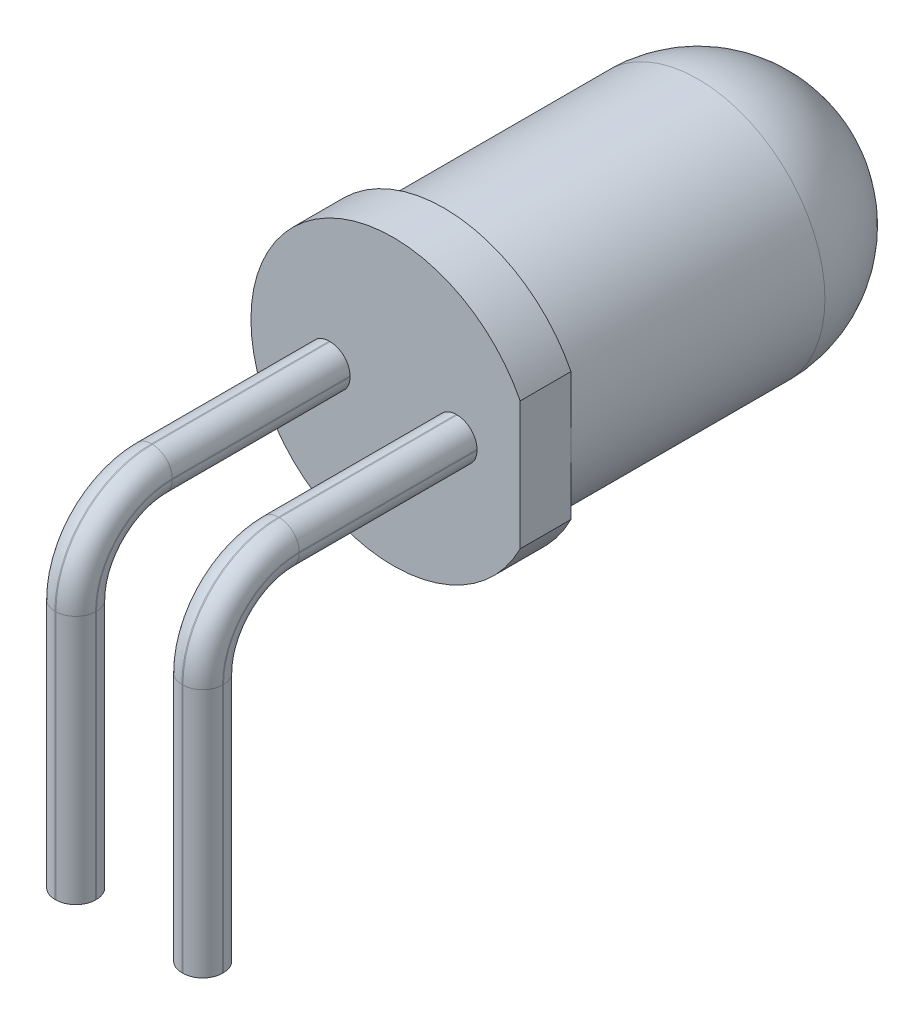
ISO-10303-21;
HEADER;
FILE_DESCRIPTION(('STEP AP214'),'2;1');
FILE_NAME('part.step','',(''),(''),'','','');
FILE_SCHEMA(('AUTOMOTIVE_DESIGN { 1 0 10303 214 1 1 1 1 }'));
ENDSEC;
DATA;
#1=APPLICATION_CONTEXT('core data for automotive mechanical design processes');
#2=APPLICATION_PROTOCOL_DEFINITION('international standard','automotive_design',2000,#1);
#3=PRODUCT_CONTEXT('',#1,'mechanical');
#4=PRODUCT('Part','Part','',(#3));
#5=PRODUCT_RELATED_PRODUCT_CATEGORY('part','',(#4));
#6=PRODUCT_DEFINITION_FORMATION('','',#4);
#7=PRODUCT_DEFINITION_CONTEXT('part definition',#1,'design');
#8=PRODUCT_DEFINITION('design','',#6,#7);
#9=PRODUCT_DEFINITION_SHAPE('','',#8);
#10=(LENGTH_UNIT() NAMED_UNIT(*) SI_UNIT(.MILLI.,.METRE.));
#11=(NAMED_UNIT(*) PLANE_ANGLE_UNIT() SI_UNIT($,.RADIAN.));
#12=(NAMED_UNIT(*) SI_UNIT($,.STERADIAN.) SOLID_ANGLE_UNIT());
#13=UNCERTAINTY_MEASURE_WITH_UNIT(LENGTH_MEASURE(1.E-05),#10,'distance_accuracy_value','');
#14=(GEOMETRIC_REPRESENTATION_CONTEXT(3) GLOBAL_UNCERTAINTY_ASSIGNED_CONTEXT((#13)) GLOBAL_UNIT_ASSIGNED_CONTEXT((#10,
#11,#12)) REPRESENTATION_CONTEXT('',''));
#15=CARTESIAN_POINT('',(0.,0.,0.));
#16=DIRECTION('',(0.,0.,1.));
#17=DIRECTION('',(1.,0.,0.));
#18=AXIS2_PLACEMENT_3D('',#15,#16,#17);
#19=CARTESIAN_POINT('',(1.65,-1.50000032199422,11.9999992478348));
#20=DIRECTION('',(-1.,0.,0.));
#21=DIRECTION('',(0.,0.,1.));
#22=AXIS2_PLACEMENT_3D('',#19,#20,#21);
#23=CYLINDRICAL_SURFACE('',#22,1.10000032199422);
#24=DIRECTION('',(-1.,0.,0.));
#25=VECTOR('',#24,1.);
#26=CARTESIAN_POINT('',(1.65,-0.399999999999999,11.9999993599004));
#27=LINE('',#26,#25);
#28=CARTESIAN_POINT('',(-1.24,-0.399999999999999,11.9999993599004));
#29=VERTEX_POINT('',#28);
#30=CARTESIAN_POINT('',(-1.26,-0.399999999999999,11.9999993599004));
#31=VERTEX_POINT('',#30);
#32=EDGE_CURVE('E490',#29,#31,#27,.T.);
#33=ORIENTED_EDGE('',*,*,#32,.F.);
#34=CARTESIAN_POINT('',(-1.24,-1.50000032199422,11.9999992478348));
#35=DIRECTION('',(1.,0.,0.));
#36=DIRECTION('',(0.,0.,-1.));
#37=AXIS2_PLACEMENT_3D('',#34,#35,#36);
#38=CIRCLE('',#37,1.10000032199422);
#39=CARTESIAN_POINT('',(-1.24,-1.50434905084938,13.0999909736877));
#40=VERTEX_POINT('',#39);
#41=EDGE_CURVE('E377',#29,#40,#38,.T.);
#42=ORIENTED_EDGE('',*,*,#41,.T.);
#43=DIRECTION('',(-1.,0.,0.));
#44=VECTOR('',#43,1.);
#45=CARTESIAN_POINT('',(1.65,-1.50434905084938,13.0999909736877));
#46=LINE('',#45,#44);
#47=CARTESIAN_POINT('',(-1.26,-1.50434905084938,13.0999909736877));
#48=VERTEX_POINT('',#47);
#49=EDGE_CURVE('E465',#40,#48,#46,.T.);
#50=ORIENTED_EDGE('',*,*,#49,.T.);
#51=CARTESIAN_POINT('',(-1.26,-1.50000032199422,11.9999992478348));
#52=DIRECTION('',(1.,0.,0.));
#53=DIRECTION('',(0.,0.,-1.));
#54=AXIS2_PLACEMENT_3D('',#51,#52,#53);
#55=CIRCLE('',#54,1.10000032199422);
#56=EDGE_CURVE('E375',#48,#31,#55,.F.);
#57=ORIENTED_EDGE('',*,*,#56,.T.);
#58=EDGE_LOOP('',(#33,#42,#50,#57));
#59=FACE_BOUND('',#58,.T.);
#60=ADVANCED_FACE('F27',(#59),#23,.F.);
#61=CARTESIAN_POINT('',(1.26,-1.50434905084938,13.0999909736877));
#62=VERTEX_POINT('',#61);
#63=CARTESIAN_POINT('',(1.24,-1.50434905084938,13.0999909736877));
#64=VERTEX_POINT('',#63);
#65=EDGE_CURVE('E469',#62,#64,#46,.T.);
#66=ORIENTED_EDGE('',*,*,#65,.T.);
#67=CARTESIAN_POINT('',(1.24,-1.50000032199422,11.9999992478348));
#68=DIRECTION('',(-1.,0.,0.));
#69=DIRECTION('',(0.,0.,1.));
#70=AXIS2_PLACEMENT_3D('',#67,#68,#69);
#71=CIRCLE('',#70,1.10000032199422);
#72=CARTESIAN_POINT('',(1.24,-0.399999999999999,11.9999993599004));
#73=VERTEX_POINT('',#72);
#74=EDGE_CURVE('E381',#64,#73,#71,.T.);
#75=ORIENTED_EDGE('',*,*,#74,.T.);
#76=CARTESIAN_POINT('',(1.26,-0.399999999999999,11.9999993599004));
#77=VERTEX_POINT('',#76);
#78=EDGE_CURVE('E259',#77,#73,#27,.T.);
#79=ORIENTED_EDGE('',*,*,#78,.F.);
#80=CARTESIAN_POINT('',(1.26,-1.50000032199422,11.9999992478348));
#81=DIRECTION('',(1.,0.,0.));
#82=DIRECTION('',(0.,0.,-1.));
#83=AXIS2_PLACEMENT_3D('',#80,#81,#82);
#84=CIRCLE('',#83,1.10000032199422);
#85=EDGE_CURVE('E379',#77,#62,#84,.T.);
#86=ORIENTED_EDGE('',*,*,#85,.T.);
#87=EDGE_LOOP('',(#66,#75,#79,#86));
#88=FACE_BOUND('',#87,.T.);
#89=ADVANCED_FACE('F620',(#88),#23,.F.);
#90=CARTESIAN_POINT('',(1.65,-0.4,8.4544798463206));
#91=DIRECTION('',(0.,1.,0.));
#92=DIRECTION('',(0.,0.,1.));
#93=AXIS2_PLACEMENT_3D('',#90,#91,#92);
#94=PLANE('',#93);
#95=DIRECTION('',(-1.,0.,0.));
#96=VECTOR('',#95,1.);
#97=CARTESIAN_POINT('',(0.,-0.4,8.5));
#98=LINE('',#97,#96);
#99=CARTESIAN_POINT('',(-1.24,-0.4,8.5));
#100=VERTEX_POINT('',#99);
#101=CARTESIAN_POINT('',(-1.26,-0.4,8.5));
#102=VERTEX_POINT('',#101);
#103=EDGE_CURVE('E297',#100,#102,#98,.T.);
#104=ORIENTED_EDGE('',*,*,#103,.F.);
#105=DIRECTION('',(0.,0.,-1.));
#106=VECTOR('',#105,1.);
#107=CARTESIAN_POINT('',(-1.24,-0.399999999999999,11.9999993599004));
#108=LINE('',#107,#106);
#109=EDGE_CURVE('E317',#100,#29,#108,.F.);
#110=ORIENTED_EDGE('',*,*,#109,.T.);
#111=ORIENTED_EDGE('',*,*,#32,.T.);
#112=DIRECTION('',(0.,0.,-1.));
#113=VECTOR('',#112,1.);
#114=CARTESIAN_POINT('',(-1.26,-0.4,8.4544798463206));
#115=LINE('',#114,#113);
#116=EDGE_CURVE('E314',#31,#102,#115,.T.);
#117=ORIENTED_EDGE('',*,*,#116,.T.);
#118=EDGE_LOOP('',(#104,#110,#111,#117));
#119=FACE_BOUND('',#118,.T.);
#120=ADVANCED_FACE('F500',(#119),#94,.F.);
#121=ORIENTED_EDGE('',*,*,#78,.T.);
#122=DIRECTION('',(0.,0.,1.));
#123=VECTOR('',#122,1.);
#124=CARTESIAN_POINT('',(1.24,-0.4,8.5));
#125=LINE('',#124,#123);
#126=CARTESIAN_POINT('',(1.24,-0.4,8.5));
#127=VERTEX_POINT('',#126);
#128=EDGE_CURVE('E347',#73,#127,#125,.F.);
#129=ORIENTED_EDGE('',*,*,#128,.T.);
#130=CARTESIAN_POINT('',(1.26,-0.4,8.5));
#131=VERTEX_POINT('',#130);
#132=EDGE_CURVE('E293',#131,#127,#98,.T.);
#133=ORIENTED_EDGE('',*,*,#132,.F.);
#134=DIRECTION('',(0.,0.,-1.));
#135=VECTOR('',#134,1.);
#136=CARTESIAN_POINT('',(1.26,-0.399999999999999,11.9999993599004));
#137=LINE('',#136,#135);
#138=EDGE_CURVE('E345',#131,#77,#137,.F.);
#139=ORIENTED_EDGE('',*,*,#138,.T.);
#140=EDGE_LOOP('',(#121,#129,#133,#139));
#141=FACE_BOUND('',#140,.T.);
#142=ADVANCED_FACE('F610',(#141),#94,.F.);
#143=CARTESIAN_POINT('',(1.65,0.4,8.4544798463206));
#144=DIRECTION('',(0.,-1.,0.));
#145=DIRECTION('',(0.,0.,-1.));
#146=AXIS2_PLACEMENT_3D('',#143,#144,#145);
#147=PLANE('',#146);
#148=DIRECTION('',(1.,0.,0.));
#149=VECTOR('',#148,1.);
#150=CARTESIAN_POINT('',(0.,0.400000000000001,8.5));
#151=LINE('',#150,#149);
#152=CARTESIAN_POINT('',(-1.26,0.400000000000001,8.5));
#153=VERTEX_POINT('',#152);
#154=CARTESIAN_POINT('',(-1.24,0.400000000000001,8.5));
#155=VERTEX_POINT('',#154);
#156=EDGE_CURVE('E292',#153,#155,#151,.T.);
#157=ORIENTED_EDGE('',*,*,#156,.F.);
#158=DIRECTION('',(0.,0.,1.));
#159=VECTOR('',#158,1.);
#160=CARTESIAN_POINT('',(-1.26,0.4,8.4544798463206));
#161=LINE('',#160,#159);
#162=CARTESIAN_POINT('',(-1.26,0.400000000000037,11.9999993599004));
#163=VERTEX_POINT('',#162);
#164=EDGE_CURVE('E385',#153,#163,#161,.T.);
#165=ORIENTED_EDGE('',*,*,#164,.T.);
#166=DIRECTION('',(-1.,0.,0.));
#167=VECTOR('',#166,1.);
#168=CARTESIAN_POINT('',(1.65,0.400000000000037,11.9999993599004));
#169=LINE('',#168,#167);
#170=CARTESIAN_POINT('',(-1.24,0.400000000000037,11.9999993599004));
#171=VERTEX_POINT('',#170);
#172=EDGE_CURVE('E486',#171,#163,#169,.T.);
#173=ORIENTED_EDGE('',*,*,#172,.F.);
#174=DIRECTION('',(0.,0.,1.));
#175=VECTOR('',#174,1.);
#176=CARTESIAN_POINT('',(-1.24,0.400000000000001,8.5));
#177=LINE('',#176,#175);
#178=EDGE_CURVE('E383',#171,#155,#177,.F.);
#179=ORIENTED_EDGE('',*,*,#178,.T.);
#180=EDGE_LOOP('',(#157,#165,#173,#179));
#181=FACE_BOUND('',#180,.T.);
#182=ADVANCED_FACE('F607',(#181),#147,.F.);
#183=CARTESIAN_POINT('',(1.24,0.400000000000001,8.5));
#184=VERTEX_POINT('',#183);
#185=CARTESIAN_POINT('',(1.26,0.400000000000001,8.5));
#186=VERTEX_POINT('',#185);
#187=EDGE_CURVE('E289',#184,#186,#151,.T.);
#188=ORIENTED_EDGE('',*,*,#187,.F.);
#189=DIRECTION('',(0.,0.,-1.));
#190=VECTOR('',#189,1.);
#191=CARTESIAN_POINT('',(1.24,0.400000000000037,11.9999993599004));
#192=LINE('',#191,#190);
#193=CARTESIAN_POINT('',(1.24,0.400000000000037,11.9999993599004));
#194=VERTEX_POINT('',#193);
#195=EDGE_CURVE('E394',#184,#194,#192,.F.);
#196=ORIENTED_EDGE('',*,*,#195,.T.);
#197=CARTESIAN_POINT('',(1.26,0.400000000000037,11.9999993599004));
#198=VERTEX_POINT('',#197);
#199=EDGE_CURVE('E488',#198,#194,#169,.T.);
#200=ORIENTED_EDGE('',*,*,#199,.F.);
#201=DIRECTION('',(0.,0.,1.));
#202=VECTOR('',#201,1.);
#203=CARTESIAN_POINT('',(1.26,0.400000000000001,8.5));
#204=LINE('',#203,#202);
#205=EDGE_CURVE('E392',#198,#186,#204,.F.);
#206=ORIENTED_EDGE('',*,*,#205,.T.);
#207=EDGE_LOOP('',(#188,#196,#200,#206));
#208=FACE_BOUND('',#207,.T.);
#209=ADVANCED_FACE('F609',(#208),#147,.F.);
#210=CARTESIAN_POINT('',(1.65,-1.50000032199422,11.9999992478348));
#211=DIRECTION('',(-1.,0.,0.));
#212=DIRECTION('',(0.,0.,1.));
#213=AXIS2_PLACEMENT_3D('',#210,#211,#212);
#214=CYLINDRICAL_SURFACE('',#213,1.90000032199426);
#215=ORIENTED_EDGE('',*,*,#172,.T.);
#216=CARTESIAN_POINT('',(-1.26,-1.50000032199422,11.9999992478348));
#217=DIRECTION('',(1.,0.,0.));
#218=DIRECTION('',(0.,0.,-1.));
#219=AXIS2_PLACEMENT_3D('',#216,#217,#218);
#220=CIRCLE('',#219,1.90000032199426);
#221=CARTESIAN_POINT('',(-1.26,-1.50289165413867,13.8999973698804));
#222=VERTEX_POINT('',#221);
#223=EDGE_CURVE('E390',#163,#222,#220,.T.);
#224=ORIENTED_EDGE('',*,*,#223,.T.);
#225=DIRECTION('',(-1.,0.,0.));
#226=VECTOR('',#225,1.);
#227=CARTESIAN_POINT('',(1.65,-1.50289165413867,13.8999973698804));
#228=LINE('',#227,#226);
#229=CARTESIAN_POINT('',(-1.24,-1.50289165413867,13.8999973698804));
#230=VERTEX_POINT('',#229);
#231=EDGE_CURVE('E487',#230,#222,#228,.T.);
#232=ORIENTED_EDGE('',*,*,#231,.F.);
#233=CARTESIAN_POINT('',(-1.24,-1.50000032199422,11.9999992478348));
#234=DIRECTION('',(1.,0.,0.));
#235=DIRECTION('',(0.,0.,-1.));
#236=AXIS2_PLACEMENT_3D('',#233,#234,#235);
#237=CIRCLE('',#236,1.90000032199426);
#238=EDGE_CURVE('E388',#230,#171,#237,.F.);
#239=ORIENTED_EDGE('',*,*,#238,.T.);
#240=EDGE_LOOP('',(#215,#224,#232,#239));
#241=FACE_BOUND('',#240,.T.);
#242=ADVANCED_FACE('F605',(#241),#214,.T.);
#243=ORIENTED_EDGE('',*,*,#199,.T.);
#244=CARTESIAN_POINT('',(1.24,-1.50000032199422,11.9999992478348));
#245=DIRECTION('',(-1.,0.,0.));
#246=DIRECTION('',(0.,0.,1.));
#247=AXIS2_PLACEMENT_3D('',#244,#245,#246);
#248=CIRCLE('',#247,1.90000032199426);
#249=CARTESIAN_POINT('',(1.24,-1.50289165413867,13.8999973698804));
#250=VERTEX_POINT('',#249);
#251=EDGE_CURVE('E398',#194,#250,#248,.F.);
#252=ORIENTED_EDGE('',*,*,#251,.T.);
#253=CARTESIAN_POINT('',(1.26,-1.50289165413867,13.8999973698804));
#254=VERTEX_POINT('',#253);
#255=EDGE_CURVE('E483',#254,#250,#228,.T.);
#256=ORIENTED_EDGE('',*,*,#255,.F.);
#257=CARTESIAN_POINT('',(1.26,-1.50000032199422,11.9999992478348));
#258=DIRECTION('',(1.,0.,0.));
#259=DIRECTION('',(0.,0.,-1.));
#260=AXIS2_PLACEMENT_3D('',#257,#258,#259);
#261=CIRCLE('',#260,1.90000032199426);
#262=EDGE_CURVE('E396',#254,#198,#261,.F.);
#263=ORIENTED_EDGE('',*,*,#262,.T.);
#264=EDGE_LOOP('',(#243,#252,#256,#263));
#265=FACE_BOUND('',#264,.T.);
#266=ADVANCED_FACE('F854',(#265),#214,.T.);
#267=CARTESIAN_POINT('',(1.65,-6.41788355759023,13.8999973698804));
#268=DIRECTION('',(0.,0.,-1.));
#269=DIRECTION('',(-1.,0.,0.));
#270=AXIS2_PLACEMENT_3D('',#267,#268,#269);
#271=PLANE('',#270);
#272=ORIENTED_EDGE('',*,*,#231,.T.);
#273=DIRECTION('',(0.,-1.,0.));
#274=VECTOR('',#273,1.);
#275=CARTESIAN_POINT('',(-1.26,-6.41788355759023,13.8999973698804));
#276=LINE('',#275,#274);
#277=CARTESIAN_POINT('',(-1.26,-6.41788355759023,13.8999973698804));
#278=VERTEX_POINT('',#277);
#279=EDGE_CURVE('E42',#222,#278,#276,.T.);
#280=ORIENTED_EDGE('',*,*,#279,.T.);
#281=DIRECTION('',(-1.,0.,0.));
#282=VECTOR('',#281,1.);
#283=CARTESIAN_POINT('',(1.65,-6.41788355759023,13.8999973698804));
#284=LINE('',#283,#282);
#285=CARTESIAN_POINT('',(-1.24,-6.41788355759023,13.8999973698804));
#286=VERTEX_POINT('',#285);
#287=EDGE_CURVE('E480',#286,#278,#284,.T.);
#288=ORIENTED_EDGE('',*,*,#287,.F.);
#289=DIRECTION('',(0.,-1.,0.));
#290=VECTOR('',#289,1.);
#291=CARTESIAN_POINT('',(-1.24,-1.50289165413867,13.8999973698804));
#292=LINE('',#291,#290);
#293=EDGE_CURVE('E415',#286,#230,#292,.F.);
#294=ORIENTED_EDGE('',*,*,#293,.T.);
#295=EDGE_LOOP('',(#272,#280,#288,#294));
#296=FACE_BOUND('',#295,.T.);
#297=ADVANCED_FACE('F852',(#296),#271,.F.);
#298=CARTESIAN_POINT('',(1.26,-6.41788355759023,13.8999973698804));
#299=VERTEX_POINT('',#298);
#300=CARTESIAN_POINT('',(1.24,-6.41788355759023,13.8999973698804));
#301=VERTEX_POINT('',#300);
#302=EDGE_CURVE('E482',#299,#301,#284,.T.);
#303=ORIENTED_EDGE('',*,*,#302,.F.);
#304=DIRECTION('',(0.,-1.,0.));
#305=VECTOR('',#304,1.);
#306=CARTESIAN_POINT('',(1.26,-1.50289165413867,13.8999973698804));
#307=LINE('',#306,#305);
#308=EDGE_CURVE('E402',#299,#254,#307,.F.);
#309=ORIENTED_EDGE('',*,*,#308,.T.);
#310=ORIENTED_EDGE('',*,*,#255,.T.);
#311=DIRECTION('',(0.,1.,0.));
#312=VECTOR('',#311,1.);
#313=CARTESIAN_POINT('',(1.24,-6.41788355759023,13.8999973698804));
#314=LINE('',#313,#312);
#315=EDGE_CURVE('E400',#250,#301,#314,.F.);
#316=ORIENTED_EDGE('',*,*,#315,.T.);
#317=EDGE_LOOP('',(#303,#309,#310,#316));
#318=FACE_BOUND('',#317,.T.);
#319=ADVANCED_FACE('F851',(#318),#271,.F.);
#320=CARTESIAN_POINT('',(1.65,-6.41788355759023,13.0999909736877));
#321=DIRECTION('',(0.,1.,0.));
#322=DIRECTION('',(0.,0.,1.));
#323=AXIS2_PLACEMENT_3D('',#320,#321,#322);
#324=PLANE('',#323);
#325=DIRECTION('',(-1.,0.,0.));
#326=VECTOR('',#325,1.);
#327=CARTESIAN_POINT('',(1.65,-6.41788355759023,13.0999909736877));
#328=LINE('',#327,#326);
#329=CARTESIAN_POINT('',(-1.24,-6.41788355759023,13.0999909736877));
#330=VERTEX_POINT('',#329);
#331=CARTESIAN_POINT('',(-1.26,-6.41788355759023,13.0999909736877));
#332=VERTEX_POINT('',#331);
#333=EDGE_CURVE('E476',#330,#332,#328,.T.);
#334=ORIENTED_EDGE('',*,*,#333,.F.);
#335=CARTESIAN_POINT('',(-1.24,-6.41788355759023,13.4899909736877));
#336=DIRECTION('',(0.,1.,0.));
#337=DIRECTION('',(0.,0.,1.));
#338=AXIS2_PLACEMENT_3D('',#335,#336,#337);
#339=CIRCLE('',#338,0.39);
#340=CARTESIAN_POINT('',(-0.85,-6.41788355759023,13.4899909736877));
#341=VERTEX_POINT('',#340);
#342=EDGE_CURVE('E413',#330,#341,#339,.F.);
#343=ORIENTED_EDGE('',*,*,#342,.T.);
#344=DIRECTION('',(0.,0.,-1.));
#345=VECTOR('',#344,1.);
#346=CARTESIAN_POINT('',(-0.85,-6.41788355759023,13.0999909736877));
#347=LINE('',#346,#345);
#348=CARTESIAN_POINT('',(-0.85,-6.41788355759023,13.5099973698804));
#349=VERTEX_POINT('',#348);
#350=EDGE_CURVE('E472',#349,#341,#347,.T.);
#351=ORIENTED_EDGE('',*,*,#350,.F.);
#352=CARTESIAN_POINT('',(-1.24,-6.41788355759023,13.5099973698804));
#353=DIRECTION('',(0.,1.,0.));
#354=DIRECTION('',(0.,0.,1.));
#355=AXIS2_PLACEMENT_3D('',#352,#353,#354);
#356=CIRCLE('',#355,0.39);
#357=EDGE_CURVE('E49',#349,#286,#356,.F.);
#358=ORIENTED_EDGE('',*,*,#357,.T.);
#359=ORIENTED_EDGE('',*,*,#287,.T.);
#360=CARTESIAN_POINT('',(-1.26,-6.41788355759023,13.5099973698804));
#361=DIRECTION('',(0.,1.,0.));
#362=DIRECTION('',(0.,0.,1.));
#363=AXIS2_PLACEMENT_3D('',#360,#361,#362);
#364=CIRCLE('',#363,0.39);
#365=CARTESIAN_POINT('',(-1.65,-6.41788355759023,13.5099973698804));
#366=VERTEX_POINT('',#365);
#367=EDGE_CURVE('E409',#278,#366,#364,.F.);
#368=ORIENTED_EDGE('',*,*,#367,.T.);
#369=DIRECTION('',(0.,0.,-1.));
#370=VECTOR('',#369,1.);
#371=CARTESIAN_POINT('',(-1.65,-6.41788355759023,13.0999909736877));
#372=LINE('',#371,#370);
#373=CARTESIAN_POINT('',(-1.65,-6.41788355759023,13.4899909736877));
#374=VERTEX_POINT('',#373);
#375=EDGE_CURVE('E466',#366,#374,#372,.T.);
#376=ORIENTED_EDGE('',*,*,#375,.T.);
#377=CARTESIAN_POINT('',(-1.26,-6.41788355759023,13.4899909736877));
#378=DIRECTION('',(0.,1.,0.));
#379=DIRECTION('',(0.,0.,1.));
#380=AXIS2_PLACEMENT_3D('',#377,#378,#379);
#381=CIRCLE('',#380,0.39);
#382=EDGE_CURVE('E411',#374,#332,#381,.F.);
#383=ORIENTED_EDGE('',*,*,#382,.T.);
#384=EDGE_LOOP('',(#334,#343,#351,#358,#359,#368,#376,#383));
#385=FACE_BOUND('',#384,.T.);
#386=ADVANCED_FACE('F848',(#385),#324,.F.);
#387=CARTESIAN_POINT('',(1.26,-6.41788355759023,13.0999909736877));
#388=VERTEX_POINT('',#387);
#389=CARTESIAN_POINT('',(1.24,-6.41788355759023,13.0999909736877));
#390=VERTEX_POINT('',#389);
#391=EDGE_CURVE('E479',#388,#390,#328,.T.);
#392=ORIENTED_EDGE('',*,*,#391,.F.);
#393=CARTESIAN_POINT('',(1.26,-6.41788355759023,13.4899909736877));
#394=DIRECTION('',(0.,1.,0.));
#395=DIRECTION('',(0.,0.,1.));
#396=AXIS2_PLACEMENT_3D('',#393,#394,#395);
#397=CIRCLE('',#396,0.39);
#398=CARTESIAN_POINT('',(1.65,-6.41788355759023,13.4899909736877));
#399=VERTEX_POINT('',#398);
#400=EDGE_CURVE('E373',#388,#399,#397,.F.);
#401=ORIENTED_EDGE('',*,*,#400,.T.);
#402=DIRECTION('',(0.,0.,-1.));
#403=VECTOR('',#402,1.);
#404=CARTESIAN_POINT('',(1.65,-6.41788355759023,13.0999909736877));
#405=LINE('',#404,#403);
#406=CARTESIAN_POINT('',(1.65,-6.41788355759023,13.5099973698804));
#407=VERTEX_POINT('',#406);
#408=EDGE_CURVE('E456',#407,#399,#405,.T.);
#409=ORIENTED_EDGE('',*,*,#408,.F.);
#410=CARTESIAN_POINT('',(1.26,-6.41788355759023,13.5099973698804));
#411=DIRECTION('',(0.,1.,0.));
#412=DIRECTION('',(0.,0.,1.));
#413=AXIS2_PLACEMENT_3D('',#410,#411,#412);
#414=CIRCLE('',#413,0.39);
#415=EDGE_CURVE('E371',#407,#299,#414,.F.);
#416=ORIENTED_EDGE('',*,*,#415,.T.);
#417=ORIENTED_EDGE('',*,*,#302,.T.);
#418=CARTESIAN_POINT('',(1.24,-6.41788355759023,13.5099973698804));
#419=DIRECTION('',(0.,1.,0.));
#420=DIRECTION('',(0.,0.,1.));
#421=AXIS2_PLACEMENT_3D('',#418,#419,#420);
#422=CIRCLE('',#421,0.39);
#423=CARTESIAN_POINT('',(0.85,-6.41788355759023,13.5099973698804));
#424=VERTEX_POINT('',#423);
#425=EDGE_CURVE('E367',#301,#424,#422,.F.);
#426=ORIENTED_EDGE('',*,*,#425,.T.);
#427=DIRECTION('',(0.,0.,1.));
#428=VECTOR('',#427,1.);
#429=CARTESIAN_POINT('',(0.85,-6.41788355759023,13.0999909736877));
#430=LINE('',#429,#428);
#431=CARTESIAN_POINT('',(0.85,-6.41788355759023,13.4899909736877));
#432=VERTEX_POINT('',#431);
#433=EDGE_CURVE('E567',#432,#424,#430,.T.);
#434=ORIENTED_EDGE('',*,*,#433,.F.);
#435=CARTESIAN_POINT('',(1.24,-6.41788355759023,13.4899909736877));
#436=DIRECTION('',(0.,1.,0.));
#437=DIRECTION('',(0.,0.,1.));
#438=AXIS2_PLACEMENT_3D('',#435,#436,#437);
#439=CIRCLE('',#438,0.39);
#440=EDGE_CURVE('E369',#432,#390,#439,.F.);
#441=ORIENTED_EDGE('',*,*,#440,.T.);
#442=EDGE_LOOP('',(#392,#401,#409,#416,#417,#426,#434,#441));
#443=FACE_BOUND('',#442,.T.);
#444=ADVANCED_FACE('F461',(#443),#324,.F.);
#445=CARTESIAN_POINT('',(1.65,-1.50434905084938,13.0999909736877));
#446=DIRECTION('',(0.,0.,1.));
#447=DIRECTION('',(1.,0.,0.));
#448=AXIS2_PLACEMENT_3D('',#445,#446,#447);
#449=PLANE('',#448);
#450=ORIENTED_EDGE('',*,*,#49,.F.);
#451=DIRECTION('',(0.,1.,0.));
#452=VECTOR('',#451,1.);
#453=CARTESIAN_POINT('',(-1.24,-6.41788355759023,13.0999909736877));
#454=LINE('',#453,#452);
#455=EDGE_CURVE('E406',#40,#330,#454,.F.);
#456=ORIENTED_EDGE('',*,*,#455,.T.);
#457=ORIENTED_EDGE('',*,*,#333,.T.);
#458=DIRECTION('',(0.,1.,0.));
#459=VECTOR('',#458,1.);
#460=CARTESIAN_POINT('',(-1.26,-1.50434905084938,13.0999909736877));
#461=LINE('',#460,#459);
#462=EDGE_CURVE('E404',#332,#48,#461,.T.);
#463=ORIENTED_EDGE('',*,*,#462,.T.);
#464=EDGE_LOOP('',(#450,#456,#457,#463));
#465=FACE_BOUND('',#464,.T.);
#466=ADVANCED_FACE('F845',(#465),#449,.F.);
#467=ORIENTED_EDGE('',*,*,#65,.F.);
#468=DIRECTION('',(0.,1.,0.));
#469=VECTOR('',#468,1.);
#470=CARTESIAN_POINT('',(1.26,-6.41788355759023,13.0999909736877));
#471=LINE('',#470,#469);
#472=EDGE_CURVE('E365',#62,#388,#471,.F.);
#473=ORIENTED_EDGE('',*,*,#472,.T.);
#474=ORIENTED_EDGE('',*,*,#391,.T.);
#475=DIRECTION('',(0.,-1.,0.));
#476=VECTOR('',#475,1.);
#477=CARTESIAN_POINT('',(1.24,-1.50434905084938,13.0999909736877));
#478=LINE('',#477,#476);
#479=EDGE_CURVE('E363',#390,#64,#478,.F.);
#480=ORIENTED_EDGE('',*,*,#479,.T.);
#481=EDGE_LOOP('',(#467,#473,#474,#480));
#482=FACE_BOUND('',#481,.T.);
#483=ADVANCED_FACE('F647',(#482),#449,.F.);
#484=CARTESIAN_POINT('',(0.,0.,8.5));
#485=DIRECTION('',(0.,0.,-1.));
#486=DIRECTION('',(-1.,0.,0.));
#487=AXIS2_PLACEMENT_3D('',#484,#485,#486);
#488=CYLINDRICAL_SURFACE('',#487,2.5);
#489=CARTESIAN_POINT('',(0.,0.,2.5));
#490=DIRECTION('',(0.,0.,-1.));
#491=DIRECTION('',(-1.,0.,0.));
#492=AXIS2_PLACEMENT_3D('',#489,#490,#491);
#493=CIRCLE('',#492,2.5);
#494=CARTESIAN_POINT('',(-2.5,0.,2.5));
#495=VERTEX_POINT('',#494);
#496=EDGE_CURVE('E283',#495,#495,#493,.F.);
#497=ORIENTED_EDGE('',*,*,#496,.T.);
#498=EDGE_LOOP('',(#497));
#499=FACE_BOUND('',#498,.T.);
#500=CARTESIAN_POINT('',(0.,0.,7.5));
#501=DIRECTION('',(0.,0.,1.));
#502=DIRECTION('',(1.,0.,0.));
#503=AXIS2_PLACEMENT_3D('',#500,#501,#502);
#504=CIRCLE('',#503,2.5);
#505=CARTESIAN_POINT('',(2.5,0.,7.5));
#506=VERTEX_POINT('',#505);
#507=EDGE_CURVE('E279',#506,#506,#504,.T.);
#508=ORIENTED_EDGE('',*,*,#507,.F.);
#509=EDGE_LOOP('',(#508));
#510=FACE_BOUND('',#509,.T.);
#511=ADVANCED_FACE('F29',(#499,#510),#488,.T.);
#512=CARTESIAN_POINT('',(0.,0.,7.5));
#513=DIRECTION('',(0.,0.,1.));
#514=DIRECTION('',(1.,0.,0.));
#515=AXIS2_PLACEMENT_3D('',#512,#513,#514);
#516=PLANE('',#515);
#517=DIRECTION('',(0.,1.,0.));
#518=VECTOR('',#517,1.);
#519=CARTESIAN_POINT('',(2.5,1.26095202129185,7.5));
#520=LINE('',#519,#518);
#521=CARTESIAN_POINT('',(2.5,1.26095202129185,7.5));
#522=VERTEX_POINT('',#521);
#523=EDGE_CURVE('E274',#506,#522,#520,.T.);
#524=ORIENTED_EDGE('',*,*,#523,.F.);
#525=ORIENTED_EDGE('',*,*,#507,.T.);
#526=CARTESIAN_POINT('',(2.5,-1.26095202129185,7.5));
#527=VERTEX_POINT('',#526);
#528=EDGE_CURVE('E270',#527,#506,#520,.T.);
#529=ORIENTED_EDGE('',*,*,#528,.F.);
#530=CARTESIAN_POINT('',(0.,0.,7.5));
#531=DIRECTION('',(0.,0.,1.));
#532=DIRECTION('',(1.,0.,0.));
#533=AXIS2_PLACEMENT_3D('',#530,#531,#532);
#534=CIRCLE('',#533,2.8);
#535=EDGE_CURVE('E265',#522,#527,#534,.T.);
#536=ORIENTED_EDGE('',*,*,#535,.F.);
#537=EDGE_LOOP('',(#524,#525,#529,#536));
#538=FACE_BOUND('',#537,.T.);
#539=ADVANCED_FACE('F632',(#538),#516,.F.);
#540=CARTESIAN_POINT('',(2.5,1.26095202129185,7.5));
#541=DIRECTION('',(1.,0.,0.));
#542=DIRECTION('',(0.,0.,-1.));
#543=AXIS2_PLACEMENT_3D('',#540,#541,#542);
#544=PLANE('',#543);
#545=ORIENTED_EDGE('',*,*,#528,.T.);
#546=ORIENTED_EDGE('',*,*,#523,.T.);
#547=DIRECTION('',(0.,0.,1.));
#548=VECTOR('',#547,1.);
#549=CARTESIAN_POINT('',(2.5,1.26095202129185,7.5));
#550=LINE('',#549,#548);
#551=CARTESIAN_POINT('',(2.5,1.26095202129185,8.5));
#552=VERTEX_POINT('',#551);
#553=EDGE_CURVE('E269',#522,#552,#550,.T.);
#554=ORIENTED_EDGE('',*,*,#553,.T.);
#555=DIRECTION('',(0.,1.,0.));
#556=VECTOR('',#555,1.);
#557=CARTESIAN_POINT('',(2.5,1.26095202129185,8.5));
#558=LINE('',#557,#556);
#559=CARTESIAN_POINT('',(2.5,-1.26095202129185,8.5));
#560=VERTEX_POINT('',#559);
#561=EDGE_CURVE('E255',#560,#552,#558,.T.);
#562=ORIENTED_EDGE('',*,*,#561,.F.);
#563=DIRECTION('',(0.,0.,1.));
#564=VECTOR('',#563,1.);
#565=CARTESIAN_POINT('',(2.5,-1.26095202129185,7.5));
#566=LINE('',#565,#564);
#567=EDGE_CURVE('E262',#527,#560,#566,.T.);
#568=ORIENTED_EDGE('',*,*,#567,.F.);
#569=EDGE_LOOP('',(#545,#546,#554,#562,#568));
#570=FACE_BOUND('',#569,.T.);
#571=ADVANCED_FACE('F272',(#570),#544,.T.);
#572=CARTESIAN_POINT('',(0.,0.,7.5));
#573=DIRECTION('',(0.,0.,1.));
#574=DIRECTION('',(1.,0.,0.));
#575=AXIS2_PLACEMENT_3D('',#572,#573,#574);
#576=CYLINDRICAL_SURFACE('',#575,2.8);
#577=CARTESIAN_POINT('',(0.,0.,8.5));
#578=DIRECTION('',(0.,0.,1.));
#579=DIRECTION('',(1.,0.,0.));
#580=AXIS2_PLACEMENT_3D('',#577,#578,#579);
#581=CIRCLE('',#580,2.8);
#582=EDGE_CURVE('E251',#552,#560,#581,.T.);
#583=ORIENTED_EDGE('',*,*,#582,.F.);
#584=ORIENTED_EDGE('',*,*,#553,.F.);
#585=ORIENTED_EDGE('',*,*,#535,.T.);
#586=ORIENTED_EDGE('',*,*,#567,.T.);
#587=EDGE_LOOP('',(#583,#584,#585,#586));
#588=FACE_BOUND('',#587,.T.);
#589=ADVANCED_FACE('F263',(#588),#576,.T.);
#590=CARTESIAN_POINT('',(0.,0.,8.5));
#591=DIRECTION('',(0.,0.,1.));
#592=DIRECTION('',(1.,0.,0.));
#593=AXIS2_PLACEMENT_3D('',#590,#591,#592);
#594=PLANE('',#593);
#595=ORIENTED_EDGE('',*,*,#156,.T.);
#596=CARTESIAN_POINT('',(-1.24,0.0100000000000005,8.5));
#597=DIRECTION('',(0.,0.,1.));
#598=DIRECTION('',(1.,0.,0.));
#599=AXIS2_PLACEMENT_3D('',#596,#597,#598);
#600=CIRCLE('',#599,0.39);
#601=CARTESIAN_POINT('',(-0.85,0.0100000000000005,8.5));
#602=VERTEX_POINT('',#601);
#603=EDGE_CURVE('E426',#155,#602,#600,.F.);
#604=ORIENTED_EDGE('',*,*,#603,.T.);
#605=DIRECTION('',(0.,-1.,0.));
#606=VECTOR('',#605,1.);
#607=CARTESIAN_POINT('',(-0.85,0.623900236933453,8.5));
#608=LINE('',#607,#606);
#609=CARTESIAN_POINT('',(-0.85,-0.01,8.5));
#610=VERTEX_POINT('',#609);
#611=EDGE_CURVE('E561',#602,#610,#608,.T.);
#612=ORIENTED_EDGE('',*,*,#611,.T.);
#613=CARTESIAN_POINT('',(-1.24,-0.0100000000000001,8.5));
#614=DIRECTION('',(0.,0.,1.));
#615=DIRECTION('',(1.,0.,0.));
#616=AXIS2_PLACEMENT_3D('',#613,#614,#615);
#617=CIRCLE('',#616,0.39);
#618=EDGE_CURVE('E418',#610,#100,#617,.F.);
#619=ORIENTED_EDGE('',*,*,#618,.T.);
#620=ORIENTED_EDGE('',*,*,#103,.T.);
#621=CARTESIAN_POINT('',(-1.26,-0.01,8.5));
#622=DIRECTION('',(0.,0.,1.));
#623=DIRECTION('',(1.,0.,0.));
#624=AXIS2_PLACEMENT_3D('',#621,#622,#623);
#625=CIRCLE('',#624,0.39);
#626=CARTESIAN_POINT('',(-1.65,-0.01,8.5));
#627=VERTEX_POINT('',#626);
#628=EDGE_CURVE('E420',#102,#627,#625,.F.);
#629=ORIENTED_EDGE('',*,*,#628,.T.);
#630=DIRECTION('',(0.,1.,0.));
#631=VECTOR('',#630,1.);
#632=CARTESIAN_POINT('',(-1.65,0.,8.5));
#633=LINE('',#632,#631);
#634=CARTESIAN_POINT('',(-1.65,0.0100000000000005,8.5));
#635=VERTEX_POINT('',#634);
#636=EDGE_CURVE('E286',#627,#635,#633,.T.);
#637=ORIENTED_EDGE('',*,*,#636,.T.);
#638=CARTESIAN_POINT('',(-1.26,0.0100000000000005,8.5));
#639=DIRECTION('',(0.,0.,1.));
#640=DIRECTION('',(1.,0.,0.));
#641=AXIS2_PLACEMENT_3D('',#638,#639,#640);
#642=CIRCLE('',#641,0.39);
#643=EDGE_CURVE('E424',#635,#153,#642,.F.);
#644=ORIENTED_EDGE('',*,*,#643,.T.);
#645=EDGE_LOOP('',(#595,#604,#612,#619,#620,#629,#637,#644));
#646=FACE_BOUND('',#645,.T.);
#647=ORIENTED_EDGE('',*,*,#132,.T.);
#648=CARTESIAN_POINT('',(1.24,-0.0100000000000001,8.5));
#649=DIRECTION('',(0.,0.,1.));
#650=DIRECTION('',(1.,0.,0.));
#651=AXIS2_PLACEMENT_3D('',#648,#649,#650);
#652=CIRCLE('',#651,0.39);
#653=CARTESIAN_POINT('',(0.85,-0.01,8.5));
#654=VERTEX_POINT('',#653);
#655=EDGE_CURVE('E422',#127,#654,#652,.F.);
#656=ORIENTED_EDGE('',*,*,#655,.T.);
#657=DIRECTION('',(0.,1.,0.));
#658=VECTOR('',#657,1.);
#659=CARTESIAN_POINT('',(0.85,0.623900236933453,8.5));
#660=LINE('',#659,#658);
#661=CARTESIAN_POINT('',(0.85,0.0100000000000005,8.5));
#662=VERTEX_POINT('',#661);
#663=EDGE_CURVE('E564',#654,#662,#660,.T.);
#664=ORIENTED_EDGE('',*,*,#663,.T.);
#665=CARTESIAN_POINT('',(1.24,0.0100000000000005,8.5));
#666=DIRECTION('',(0.,0.,1.));
#667=DIRECTION('',(1.,0.,0.));
#668=AXIS2_PLACEMENT_3D('',#665,#666,#667);
#669=CIRCLE('',#668,0.39);
#670=EDGE_CURVE('E428',#662,#184,#669,.F.);
#671=ORIENTED_EDGE('',*,*,#670,.T.);
#672=ORIENTED_EDGE('',*,*,#187,.T.);
#673=CARTESIAN_POINT('',(1.26,0.0100000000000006,8.5));
#674=DIRECTION('',(0.,0.,1.));
#675=DIRECTION('',(1.,0.,0.));
#676=AXIS2_PLACEMENT_3D('',#673,#674,#675);
#677=CIRCLE('',#676,0.39);
#678=CARTESIAN_POINT('',(1.65,0.0100000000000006,8.5));
#679=VERTEX_POINT('',#678);
#680=EDGE_CURVE('E35',#186,#679,#677,.F.);
#681=ORIENTED_EDGE('',*,*,#680,.T.);
#682=DIRECTION('',(0.,1.,0.));
#683=VECTOR('',#682,1.);
#684=CARTESIAN_POINT('',(1.65,0.,8.5));
#685=LINE('',#684,#683);
#686=CARTESIAN_POINT('',(1.65,-0.0100000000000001,8.5));
#687=VERTEX_POINT('',#686);
#688=EDGE_CURVE('E296',#687,#679,#685,.T.);
#689=ORIENTED_EDGE('',*,*,#688,.F.);
#690=CARTESIAN_POINT('',(1.26,-0.0100000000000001,8.5));
#691=DIRECTION('',(0.,0.,1.));
#692=DIRECTION('',(1.,0.,0.));
#693=AXIS2_PLACEMENT_3D('',#690,#691,#692);
#694=CIRCLE('',#693,0.39);
#695=EDGE_CURVE('E11',#687,#131,#694,.F.);
#696=ORIENTED_EDGE('',*,*,#695,.T.);
#697=EDGE_LOOP('',(#647,#656,#664,#671,#672,#681,#689,#696));
#698=FACE_BOUND('',#697,.T.);
#699=ORIENTED_EDGE('',*,*,#582,.T.);
#700=ORIENTED_EDGE('',*,*,#561,.T.);
#701=EDGE_LOOP('',(#699,#700));
#702=FACE_BOUND('',#701,.T.);
#703=ADVANCED_FACE('F253',(#646,#698,#702),#594,.T.);
#704=CARTESIAN_POINT('',(0.,0.,2.5));
#705=DIRECTION('',(0.,0.,1.));
#706=DIRECTION('',(1.,0.,0.));
#707=AXIS2_PLACEMENT_3D('',#704,#705,#706);
#708=SPHERICAL_SURFACE('',#707,2.5);
#709=ORIENTED_EDGE('',*,*,#496,.F.);
#710=EDGE_LOOP('',(#709));
#711=FACE_BOUND('',#710,.T.);
#712=ADVANCED_FACE('F628',(#711),#708,.T.);
#713=CARTESIAN_POINT('',(1.65,-1.50000032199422,11.9999992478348));
#714=DIRECTION('',(1.,0.,0.));
#715=DIRECTION('',(0.,0.,-1.));
#716=AXIS2_PLACEMENT_3D('',#713,#714,#715);
#717=PLANE('',#716);
#718=CARTESIAN_POINT('',(1.65,-1.50000032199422,11.9999992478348));
#719=DIRECTION('',(1.,0.,0.));
#720=DIRECTION('',(0.,0.,-1.));
#721=AXIS2_PLACEMENT_3D('',#718,#719,#720);
#722=CIRCLE('',#721,1.51000032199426);
#723=CARTESIAN_POINT('',(1.65,0.0100000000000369,11.9999993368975));
#724=VERTEX_POINT('',#723);
#725=CARTESIAN_POINT('',(1.65,-1.50289165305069,13.509996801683));
#726=VERTEX_POINT('',#725);
#727=EDGE_CURVE('E358',#724,#726,#722,.T.);
#728=ORIENTED_EDGE('',*,*,#727,.T.);
#729=DIRECTION('',(0.,-1.,0.));
#730=VECTOR('',#729,1.);
#731=CARTESIAN_POINT('',(1.65,-6.41788355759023,13.5099973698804));
#732=LINE('',#731,#730);
#733=EDGE_CURVE('E360',#726,#407,#732,.T.);
#734=ORIENTED_EDGE('',*,*,#733,.T.);
#735=ORIENTED_EDGE('',*,*,#408,.T.);
#736=DIRECTION('',(0.,1.,0.));
#737=VECTOR('',#736,1.);
#738=CARTESIAN_POINT('',(1.65,-1.50434905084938,13.4899909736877));
#739=LINE('',#738,#737);
#740=CARTESIAN_POINT('',(1.65,-1.50434905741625,13.4899932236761));
#741=VERTEX_POINT('',#740);
#742=EDGE_CURVE('E353',#399,#741,#739,.T.);
#743=ORIENTED_EDGE('',*,*,#742,.T.);
#744=CARTESIAN_POINT('',(1.65,-1.50000032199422,11.9999992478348));
#745=DIRECTION('',(1.,0.,0.));
#746=DIRECTION('',(0.,0.,-1.));
#747=AXIS2_PLACEMENT_3D('',#744,#745,#746);
#748=CIRCLE('',#747,1.49000032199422);
#749=CARTESIAN_POINT('',(1.65,-0.00999999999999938,11.9999993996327));
#750=VERTEX_POINT('',#749);
#751=EDGE_CURVE('E351',#741,#750,#748,.F.);
#752=ORIENTED_EDGE('',*,*,#751,.T.);
#753=DIRECTION('',(0.,0.,-1.));
#754=VECTOR('',#753,1.);
#755=CARTESIAN_POINT('',(1.65,-0.0100000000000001,8.5));
#756=LINE('',#755,#754);
#757=EDGE_CURVE('E349',#750,#687,#756,.T.);
#758=ORIENTED_EDGE('',*,*,#757,.T.);
#759=ORIENTED_EDGE('',*,*,#688,.T.);
#760=DIRECTION('',(0.,0.,1.));
#761=VECTOR('',#760,1.);
#762=CARTESIAN_POINT('',(1.65,0.0100000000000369,11.9999993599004));
#763=LINE('',#762,#761);
#764=EDGE_CURVE('E356',#679,#724,#763,.T.);
#765=ORIENTED_EDGE('',*,*,#764,.T.);
#766=EDGE_LOOP('',(#728,#734,#735,#743,#752,#758,#759,#765));
#767=FACE_BOUND('',#766,.T.);
#768=ADVANCED_FACE('F438',(#767),#717,.T.);
#769=CARTESIAN_POINT('',(-1.65,-1.50000032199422,11.9999992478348));
#770=DIRECTION('',(1.,0.,0.));
#771=DIRECTION('',(0.,0.,-1.));
#772=AXIS2_PLACEMENT_3D('',#769,#770,#771);
#773=PLANE('',#772);
#774=ORIENTED_EDGE('',*,*,#636,.F.);
#775=DIRECTION('',(0.,0.,-1.));
#776=VECTOR('',#775,1.);
#777=CARTESIAN_POINT('',(-1.65,-0.00999999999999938,11.9999992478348));
#778=LINE('',#777,#776);
#779=CARTESIAN_POINT('',(-1.65,-0.00999999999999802,11.9999993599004));
#780=VERTEX_POINT('',#779);
#781=EDGE_CURVE('E329',#627,#780,#778,.F.);
#782=ORIENTED_EDGE('',*,*,#781,.T.);
#783=CARTESIAN_POINT('',(-1.65,-1.50000032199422,11.9999992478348));
#784=DIRECTION('',(1.,0.,0.));
#785=DIRECTION('',(0.,0.,-1.));
#786=AXIS2_PLACEMENT_3D('',#783,#784,#785);
#787=CIRCLE('',#786,1.49000032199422);
#788=CARTESIAN_POINT('',(-1.65,-1.5058908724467,13.4899909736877));
#789=VERTEX_POINT('',#788);
#790=EDGE_CURVE('E327',#780,#789,#787,.T.);
#791=ORIENTED_EDGE('',*,*,#790,.T.);
#792=DIRECTION('',(0.,1.,0.));
#793=VECTOR('',#792,1.);
#794=CARTESIAN_POINT('',(-1.65,-1.50000032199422,13.4899909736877));
#795=LINE('',#794,#793);
#796=EDGE_CURVE('E325',#789,#374,#795,.F.);
#797=ORIENTED_EDGE('',*,*,#796,.T.);
#798=ORIENTED_EDGE('',*,*,#375,.F.);
#799=DIRECTION('',(0.,-1.,0.));
#800=VECTOR('',#799,1.);
#801=CARTESIAN_POINT('',(-1.65,-1.50000032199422,13.5099973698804));
#802=LINE('',#801,#800);
#803=CARTESIAN_POINT('',(-1.65,-1.50229817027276,13.5099973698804));
#804=VERTEX_POINT('',#803);
#805=EDGE_CURVE('E319',#366,#804,#802,.F.);
#806=ORIENTED_EDGE('',*,*,#805,.T.);
#807=CARTESIAN_POINT('',(-1.65,-1.50000032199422,11.9999992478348));
#808=DIRECTION('',(1.,0.,0.));
#809=DIRECTION('',(0.,0.,-1.));
#810=AXIS2_PLACEMENT_3D('',#807,#808,#809);
#811=CIRCLE('',#810,1.51000032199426);
#812=CARTESIAN_POINT('',(-1.65,0.0100000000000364,11.9999993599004));
#813=VERTEX_POINT('',#812);
#814=EDGE_CURVE('E321',#804,#813,#811,.F.);
#815=ORIENTED_EDGE('',*,*,#814,.T.);
#816=DIRECTION('',(0.,0.,1.));
#817=VECTOR('',#816,1.);
#818=CARTESIAN_POINT('',(-1.65,0.0100000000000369,11.9999992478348));
#819=LINE('',#818,#817);
#820=EDGE_CURVE('E323',#813,#635,#819,.F.);
#821=ORIENTED_EDGE('',*,*,#820,.T.);
#822=EDGE_LOOP('',(#774,#782,#791,#797,#798,#806,#815,#821));
#823=FACE_BOUND('',#822,.T.);
#824=ADVANCED_FACE('F524',(#823),#773,.F.);
#825=CARTESIAN_POINT('',(-0.85,0.623900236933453,18.5));
#826=DIRECTION('',(1.,0.,0.));
#827=DIRECTION('',(0.,0.,-1.));
#828=AXIS2_PLACEMENT_3D('',#825,#826,#827);
#829=PLANE('',#828);
#830=CARTESIAN_POINT('',(-0.85,-1.50000032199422,11.9999992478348));
#831=DIRECTION('',(1.,0.,0.));
#832=DIRECTION('',(0.,0.,-1.));
#833=AXIS2_PLACEMENT_3D('',#830,#831,#832);
#834=CIRCLE('',#833,1.49000032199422);
#835=CARTESIAN_POINT('',(-0.85,-1.5058908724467,13.4899909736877));
#836=VERTEX_POINT('',#835);
#837=CARTESIAN_POINT('',(-0.85,-0.00999999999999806,11.9999993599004));
#838=VERTEX_POINT('',#837);
#839=EDGE_CURVE('E309',#836,#838,#834,.F.);
#840=ORIENTED_EDGE('',*,*,#839,.T.);
#841=DIRECTION('',(0.,0.,-1.));
#842=VECTOR('',#841,1.);
#843=CARTESIAN_POINT('',(-0.85,-0.0100000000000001,8.5));
#844=LINE('',#843,#842);
#845=EDGE_CURVE('E311',#838,#610,#844,.T.);
#846=ORIENTED_EDGE('',*,*,#845,.T.);
#847=ORIENTED_EDGE('',*,*,#611,.F.);
#848=DIRECTION('',(0.,0.,1.));
#849=VECTOR('',#848,1.);
#850=CARTESIAN_POINT('',(-0.85,0.0100000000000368,11.9999993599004));
#851=LINE('',#850,#849);
#852=CARTESIAN_POINT('',(-0.85,0.0100000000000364,11.9999993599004));
#853=VERTEX_POINT('',#852);
#854=EDGE_CURVE('E304',#602,#853,#851,.T.);
#855=ORIENTED_EDGE('',*,*,#854,.T.);
#856=CARTESIAN_POINT('',(-0.85,-1.50000032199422,11.9999992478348));
#857=DIRECTION('',(1.,0.,0.));
#858=DIRECTION('',(0.,0.,-1.));
#859=AXIS2_PLACEMENT_3D('',#856,#857,#858);
#860=CIRCLE('',#859,1.51000032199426);
#861=CARTESIAN_POINT('',(-0.85,-1.50229817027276,13.5099973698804));
#862=VERTEX_POINT('',#861);
#863=EDGE_CURVE('E302',#853,#862,#860,.T.);
#864=ORIENTED_EDGE('',*,*,#863,.T.);
#865=DIRECTION('',(0.,-1.,0.));
#866=VECTOR('',#865,1.);
#867=CARTESIAN_POINT('',(-0.85,-6.41788355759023,13.5099973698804));
#868=LINE('',#867,#866);
#869=EDGE_CURVE('E300',#862,#349,#868,.T.);
#870=ORIENTED_EDGE('',*,*,#869,.T.);
#871=ORIENTED_EDGE('',*,*,#350,.T.);
#872=DIRECTION('',(0.,1.,0.));
#873=VECTOR('',#872,1.);
#874=CARTESIAN_POINT('',(-0.85,-1.50434905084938,13.4899909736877));
#875=LINE('',#874,#873);
#876=EDGE_CURVE('E307',#341,#836,#875,.T.);
#877=ORIENTED_EDGE('',*,*,#876,.T.);
#878=EDGE_LOOP('',(#840,#846,#847,#855,#864,#870,#871,#877));
#879=FACE_BOUND('',#878,.T.);
#880=ADVANCED_FACE('F572',(#879),#829,.T.);
#881=CARTESIAN_POINT('',(0.85,0.623900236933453,18.5));
#882=DIRECTION('',(-1.,0.,0.));
#883=DIRECTION('',(0.,0.,1.));
#884=AXIS2_PLACEMENT_3D('',#881,#882,#883);
#885=PLANE('',#884);
#886=ORIENTED_EDGE('',*,*,#663,.F.);
#887=DIRECTION('',(0.,0.,1.));
#888=VECTOR('',#887,1.);
#889=CARTESIAN_POINT('',(0.85,-0.00999999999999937,11.9999993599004));
#890=LINE('',#889,#888);
#891=CARTESIAN_POINT('',(0.85,-0.00999999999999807,11.9999993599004));
#892=VERTEX_POINT('',#891);
#893=EDGE_CURVE('E342',#654,#892,#890,.T.);
#894=ORIENTED_EDGE('',*,*,#893,.T.);
#895=CARTESIAN_POINT('',(0.85,-1.50000032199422,11.9999992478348));
#896=DIRECTION('',(-1.,0.,0.));
#897=DIRECTION('',(0.,0.,1.));
#898=AXIS2_PLACEMENT_3D('',#895,#896,#897);
#899=CIRCLE('',#898,1.49000032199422);
#900=CARTESIAN_POINT('',(0.85,-1.5058908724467,13.4899909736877));
#901=VERTEX_POINT('',#900);
#902=EDGE_CURVE('E340',#892,#901,#899,.F.);
#903=ORIENTED_EDGE('',*,*,#902,.T.);
#904=DIRECTION('',(0.,-1.,0.));
#905=VECTOR('',#904,1.);
#906=CARTESIAN_POINT('',(0.85,-6.41788355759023,13.4899909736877));
#907=LINE('',#906,#905);
#908=EDGE_CURVE('E338',#901,#432,#907,.T.);
#909=ORIENTED_EDGE('',*,*,#908,.T.);
#910=ORIENTED_EDGE('',*,*,#433,.T.);
#911=DIRECTION('',(0.,1.,0.));
#912=VECTOR('',#911,1.);
#913=CARTESIAN_POINT('',(0.85,-1.50289165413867,13.5099973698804));
#914=LINE('',#913,#912);
#915=CARTESIAN_POINT('',(0.85,-1.50229817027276,13.5099973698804));
#916=VERTEX_POINT('',#915);
#917=EDGE_CURVE('E331',#424,#916,#914,.T.);
#918=ORIENTED_EDGE('',*,*,#917,.T.);
#919=CARTESIAN_POINT('',(0.85,-1.50000032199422,11.9999992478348));
#920=DIRECTION('',(-1.,0.,0.));
#921=DIRECTION('',(0.,0.,1.));
#922=AXIS2_PLACEMENT_3D('',#919,#920,#921);
#923=CIRCLE('',#922,1.51000032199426);
#924=CARTESIAN_POINT('',(0.85,0.0100000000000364,11.9999993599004));
#925=VERTEX_POINT('',#924);
#926=EDGE_CURVE('E333',#916,#925,#923,.T.);
#927=ORIENTED_EDGE('',*,*,#926,.T.);
#928=DIRECTION('',(0.,0.,-1.));
#929=VECTOR('',#928,1.);
#930=CARTESIAN_POINT('',(0.85,0.0100000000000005,8.5));
#931=LINE('',#930,#929);
#932=EDGE_CURVE('E335',#925,#662,#931,.T.);
#933=ORIENTED_EDGE('',*,*,#932,.T.);
#934=EDGE_LOOP('',(#886,#894,#903,#909,#910,#918,#927,#933));
#935=FACE_BOUND('',#934,.T.);
#936=ADVANCED_FACE('F666',(#935),#885,.T.);
#937=CARTESIAN_POINT('',(-1.24,0.623900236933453,13.4899909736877));
#938=DIRECTION('',(0.,-1.,0.));
#939=DIRECTION('',(0.,0.,-1.));
#940=AXIS2_PLACEMENT_3D('',#937,#938,#939);
#941=CYLINDRICAL_SURFACE('',#940,0.39);
#942=ORIENTED_EDGE('',*,*,#342,.F.);
#943=ORIENTED_EDGE('',*,*,#455,.F.);
#944=CARTESIAN_POINT('',(-1.24,-1.5058908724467,13.4899909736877));
#945=DIRECTION('',(0.,0.999992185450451,0.00395335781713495));
#946=DIRECTION('',(0.,-0.00395335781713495,0.999992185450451));
#947=AXIS2_PLACEMENT_3D('',#944,#945,#946);
#948=CIRCLE('',#947,0.39);
#949=EDGE_CURVE('E558',#836,#40,#948,.T.);
#950=ORIENTED_EDGE('',*,*,#949,.F.);
#951=ORIENTED_EDGE('',*,*,#876,.F.);
#952=EDGE_LOOP('',(#942,#943,#950,#951));
#953=FACE_BOUND('',#952,.T.);
#954=ADVANCED_FACE('F577',(#953),#941,.T.);
#955=CARTESIAN_POINT('',(-1.24,-1.50000032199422,11.9999992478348));
#956=DIRECTION('',(1.,0.,0.));
#957=DIRECTION('',(0.,0.,-1.));
#958=AXIS2_PLACEMENT_3D('',#955,#956,#957);
#959=TOROIDAL_SURFACE('',#958,1.49000032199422,0.39);
#960=ORIENTED_EDGE('',*,*,#949,.T.);
#961=ORIENTED_EDGE('',*,*,#41,.F.);
#962=CARTESIAN_POINT('',(-1.24,-0.00999999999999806,11.9999993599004));
#963=DIRECTION('',(0.,0.,-1.));
#964=DIRECTION('',(-1.,0.,0.));
#965=AXIS2_PLACEMENT_3D('',#962,#963,#964);
#966=CIRCLE('',#965,0.39);
#967=EDGE_CURVE('E555',#838,#29,#966,.T.);
#968=ORIENTED_EDGE('',*,*,#967,.F.);
#969=ORIENTED_EDGE('',*,*,#839,.F.);
#970=EDGE_LOOP('',(#960,#961,#968,#969));
#971=FACE_BOUND('',#970,.T.);
#972=ADVANCED_FACE('F582',(#971),#959,.T.);
#973=CARTESIAN_POINT('',(-1.24,-0.00999999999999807,18.5));
#974=DIRECTION('',(0.,0.,1.));
#975=DIRECTION('',(0.,-1.,0.));
#976=AXIS2_PLACEMENT_3D('',#973,#974,#975);
#977=CYLINDRICAL_SURFACE('',#976,0.39);
#978=ORIENTED_EDGE('',*,*,#967,.T.);
#979=ORIENTED_EDGE('',*,*,#109,.F.);
#980=ORIENTED_EDGE('',*,*,#618,.F.);
#981=ORIENTED_EDGE('',*,*,#845,.F.);
#982=EDGE_LOOP('',(#978,#979,#980,#981));
#983=FACE_BOUND('',#982,.T.);
#984=ADVANCED_FACE('F686',(#983),#977,.T.);
#985=CARTESIAN_POINT('',(-1.26,-1.50434905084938,13.4899909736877));
#986=DIRECTION('',(0.,1.,0.));
#987=DIRECTION('',(0.,0.,1.));
#988=AXIS2_PLACEMENT_3D('',#985,#986,#987);
#989=CYLINDRICAL_SURFACE('',#988,0.39);
#990=ORIENTED_EDGE('',*,*,#382,.F.);
#991=ORIENTED_EDGE('',*,*,#796,.F.);
#992=CARTESIAN_POINT('',(-1.26,-1.50434905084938,13.4899909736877));
#993=DIRECTION('',(-0.00395335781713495,0.999992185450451,0.));
#994=DIRECTION('',(-0.999992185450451,-0.00395335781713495,0.));
#995=AXIS2_PLACEMENT_3D('',#992,#993,#994);
#996=CIRCLE('',#995,0.39);
#997=EDGE_CURVE('E515',#48,#789,#996,.T.);
#998=ORIENTED_EDGE('',*,*,#997,.F.);
#999=ORIENTED_EDGE('',*,*,#462,.F.);
#1000=EDGE_LOOP('',(#990,#991,#998,#999));
#1001=FACE_BOUND('',#1000,.T.);
#1002=ADVANCED_FACE('F693',(#1001),#989,.T.);
#1003=CARTESIAN_POINT('',(-1.26,-1.50000032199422,11.9999992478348));
#1004=DIRECTION('',(1.,0.,0.));
#1005=DIRECTION('',(0.,0.,-1.));
#1006=AXIS2_PLACEMENT_3D('',#1003,#1004,#1005);
#1007=TOROIDAL_SURFACE('',#1006,1.49000032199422,0.39);
#1008=ORIENTED_EDGE('',*,*,#997,.T.);
#1009=ORIENTED_EDGE('',*,*,#790,.F.);
#1010=CARTESIAN_POINT('',(-1.26,-0.0100000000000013,11.9999993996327));
#1011=DIRECTION('',(1.01877752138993E-07,1.01877752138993E-07,-0.99999999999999));
#1012=DIRECTION('',(-0.999999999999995,0.,-1.01877752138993E-07));
#1013=AXIS2_PLACEMENT_3D('',#1010,#1011,#1012);
#1014=CIRCLE('',#1013,0.39);
#1015=EDGE_CURVE('E510',#31,#780,#1014,.T.);
#1016=ORIENTED_EDGE('',*,*,#1015,.F.);
#1017=ORIENTED_EDGE('',*,*,#56,.F.);
#1018=EDGE_LOOP('',(#1008,#1009,#1016,#1017));
#1019=FACE_BOUND('',#1018,.T.);
#1020=ADVANCED_FACE('F512',(#1019),#1007,.T.);
#1021=CARTESIAN_POINT('',(-1.26,-0.01,8.4544798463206));
#1022=DIRECTION('',(0.,0.,-1.));
#1023=DIRECTION('',(0.,1.,0.));
#1024=AXIS2_PLACEMENT_3D('',#1021,#1022,#1023);
#1025=CYLINDRICAL_SURFACE('',#1024,0.39);
#1026=ORIENTED_EDGE('',*,*,#1015,.T.);
#1027=ORIENTED_EDGE('',*,*,#781,.F.);
#1028=ORIENTED_EDGE('',*,*,#628,.F.);
#1029=ORIENTED_EDGE('',*,*,#116,.F.);
#1030=EDGE_LOOP('',(#1026,#1027,#1028,#1029));
#1031=FACE_BOUND('',#1030,.T.);
#1032=ADVANCED_FACE('F518',(#1031),#1025,.T.);
#1033=CARTESIAN_POINT('',(1.24,0.623900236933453,13.4899909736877));
#1034=DIRECTION('',(0.,1.,0.));
#1035=DIRECTION('',(0.,0.,1.));
#1036=AXIS2_PLACEMENT_3D('',#1033,#1034,#1035);
#1037=CYLINDRICAL_SURFACE('',#1036,0.39);
#1038=ORIENTED_EDGE('',*,*,#440,.F.);
#1039=ORIENTED_EDGE('',*,*,#908,.F.);
#1040=CARTESIAN_POINT('',(1.24,-1.50434905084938,13.4899909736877));
#1041=DIRECTION('',(-0.00395335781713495,0.999992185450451,0.));
#1042=DIRECTION('',(-0.999992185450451,-0.00395335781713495,0.));
#1043=AXIS2_PLACEMENT_3D('',#1040,#1041,#1042);
#1044=CIRCLE('',#1043,0.39);
#1045=EDGE_CURVE('E516',#64,#901,#1044,.T.);
#1046=ORIENTED_EDGE('',*,*,#1045,.F.);
#1047=ORIENTED_EDGE('',*,*,#479,.F.);
#1048=EDGE_LOOP('',(#1038,#1039,#1046,#1047));
#1049=FACE_BOUND('',#1048,.T.);
#1050=ADVANCED_FACE('F713',(#1049),#1037,.T.);
#1051=CARTESIAN_POINT('',(1.24,-1.50000032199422,11.9999992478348));
#1052=DIRECTION('',(-1.,0.,0.));
#1053=DIRECTION('',(0.,0.,1.));
#1054=AXIS2_PLACEMENT_3D('',#1051,#1052,#1053);
#1055=TOROIDAL_SURFACE('',#1054,1.49000032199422,0.39);
#1056=ORIENTED_EDGE('',*,*,#1045,.T.);
#1057=ORIENTED_EDGE('',*,*,#902,.F.);
#1058=CARTESIAN_POINT('',(1.24,-0.0100000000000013,11.9999993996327));
#1059=DIRECTION('',(1.01877752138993E-07,1.01877752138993E-07,-0.99999999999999));
#1060=DIRECTION('',(-0.999999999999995,0.,-1.01877752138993E-07));
#1061=AXIS2_PLACEMENT_3D('',#1058,#1059,#1060);
#1062=CIRCLE('',#1061,0.39);
#1063=EDGE_CURVE('E550',#73,#892,#1062,.T.);
#1064=ORIENTED_EDGE('',*,*,#1063,.F.);
#1065=ORIENTED_EDGE('',*,*,#74,.F.);
#1066=EDGE_LOOP('',(#1056,#1057,#1064,#1065));
#1067=FACE_BOUND('',#1066,.T.);
#1068=ADVANCED_FACE('F720',(#1067),#1055,.T.);
#1069=CARTESIAN_POINT('',(1.24,-0.00999999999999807,18.5));
#1070=DIRECTION('',(0.,0.,-1.));
#1071=DIRECTION('',(0.,1.,0.));
#1072=AXIS2_PLACEMENT_3D('',#1069,#1070,#1071);
#1073=CYLINDRICAL_SURFACE('',#1072,0.39);
#1074=ORIENTED_EDGE('',*,*,#655,.F.);
#1075=ORIENTED_EDGE('',*,*,#128,.F.);
#1076=ORIENTED_EDGE('',*,*,#1063,.T.);
#1077=ORIENTED_EDGE('',*,*,#893,.F.);
#1078=EDGE_LOOP('',(#1074,#1075,#1076,#1077));
#1079=FACE_BOUND('',#1078,.T.);
#1080=ADVANCED_FACE('F728',(#1079),#1073,.T.);
#1081=CARTESIAN_POINT('',(1.26,-0.00999999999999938,11.9999992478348));
#1082=DIRECTION('',(0.,0.,1.));
#1083=DIRECTION('',(0.,-1.,0.));
#1084=AXIS2_PLACEMENT_3D('',#1081,#1082,#1083);
#1085=CYLINDRICAL_SURFACE('',#1084,0.39);
#1086=ORIENTED_EDGE('',*,*,#695,.F.);
#1087=ORIENTED_EDGE('',*,*,#757,.F.);
#1088=CARTESIAN_POINT('',(1.26,-0.00999999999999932,11.9999993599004));
#1089=DIRECTION('',(-1.01877752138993E-07,0.,0.999999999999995));
#1090=DIRECTION('',(0.999999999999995,0.,1.01877752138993E-07));
#1091=AXIS2_PLACEMENT_3D('',#1088,#1089,#1090);
#1092=CIRCLE('',#1091,0.39);
#1093=EDGE_CURVE('E547',#77,#750,#1092,.T.);
#1094=ORIENTED_EDGE('',*,*,#1093,.F.);
#1095=ORIENTED_EDGE('',*,*,#138,.F.);
#1096=EDGE_LOOP('',(#1086,#1087,#1094,#1095));
#1097=FACE_BOUND('',#1096,.T.);
#1098=ADVANCED_FACE('F736',(#1097),#1085,.T.);
#1099=CARTESIAN_POINT('',(1.26,-1.50000032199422,11.9999992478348));
#1100=DIRECTION('',(1.,0.,0.));
#1101=DIRECTION('',(0.,0.,-1.));
#1102=AXIS2_PLACEMENT_3D('',#1099,#1100,#1101);
#1103=TOROIDAL_SURFACE('',#1102,1.49000032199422,0.39);
#1104=ORIENTED_EDGE('',*,*,#1093,.T.);
#1105=ORIENTED_EDGE('',*,*,#751,.F.);
#1106=CARTESIAN_POINT('',(1.26,-1.5058908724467,13.4899879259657));
#1107=DIRECTION('',(0.00395336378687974,-0.999984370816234,-0.00395335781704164));
#1108=DIRECTION('',(0.999992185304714,0.00395339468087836,0.));
#1109=AXIS2_PLACEMENT_3D('',#1106,#1107,#1108);
#1110=CIRCLE('',#1109,0.39);
#1111=EDGE_CURVE('E539',#62,#741,#1110,.T.);
#1112=ORIENTED_EDGE('',*,*,#1111,.F.);
#1113=ORIENTED_EDGE('',*,*,#85,.F.);
#1114=EDGE_LOOP('',(#1104,#1105,#1112,#1113));
#1115=FACE_BOUND('',#1114,.T.);
#1116=ADVANCED_FACE('F744',(#1115),#1103,.T.);
#1117=CARTESIAN_POINT('',(1.26,-1.50000032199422,13.4899909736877));
#1118=DIRECTION('',(0.,-1.,0.));
#1119=DIRECTION('',(0.,0.,-1.));
#1120=AXIS2_PLACEMENT_3D('',#1117,#1118,#1119);
#1121=CYLINDRICAL_SURFACE('',#1120,0.39);
#1122=ORIENTED_EDGE('',*,*,#400,.F.);
#1123=ORIENTED_EDGE('',*,*,#472,.F.);
#1124=ORIENTED_EDGE('',*,*,#1111,.T.);
#1125=ORIENTED_EDGE('',*,*,#742,.F.);
#1126=EDGE_LOOP('',(#1122,#1123,#1124,#1125));
#1127=FACE_BOUND('',#1126,.T.);
#1128=ADVANCED_FACE('F752',(#1127),#1121,.T.);
#1129=CARTESIAN_POINT('',(-1.26,-6.41788355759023,13.5099973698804));
#1130=DIRECTION('',(0.,-1.,0.));
#1131=DIRECTION('',(0.,0.,-1.));
#1132=AXIS2_PLACEMENT_3D('',#1129,#1130,#1131);
#1133=CYLINDRICAL_SURFACE('',#1132,0.39);
#1134=ORIENTED_EDGE('',*,*,#367,.F.);
#1135=ORIENTED_EDGE('',*,*,#279,.F.);
#1136=CARTESIAN_POINT('',(-1.26,-1.50229817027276,13.5099973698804));
#1137=DIRECTION('',(0.,0.99999884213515,0.0015217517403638));
#1138=DIRECTION('',(0.,-0.0015217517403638,0.99999884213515));
#1139=AXIS2_PLACEMENT_3D('',#1136,#1137,#1138);
#1140=CIRCLE('',#1139,0.39);
#1141=EDGE_CURVE('E536',#804,#222,#1140,.T.);
#1142=ORIENTED_EDGE('',*,*,#1141,.F.);
#1143=ORIENTED_EDGE('',*,*,#805,.F.);
#1144=EDGE_LOOP('',(#1134,#1135,#1142,#1143));
#1145=FACE_BOUND('',#1144,.T.);
#1146=ADVANCED_FACE('F760',(#1145),#1133,.T.);
#1147=CARTESIAN_POINT('',(-1.26,-1.50000032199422,11.9999992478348));
#1148=DIRECTION('',(1.,0.,0.));
#1149=DIRECTION('',(0.,0.,-1.));
#1150=AXIS2_PLACEMENT_3D('',#1147,#1148,#1149);
#1151=TOROIDAL_SURFACE('',#1150,1.51000032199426,0.39);
#1152=ORIENTED_EDGE('',*,*,#1141,.T.);
#1153=ORIENTED_EDGE('',*,*,#223,.F.);
#1154=CARTESIAN_POINT('',(-1.26,0.0100000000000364,11.9999993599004));
#1155=DIRECTION('',(0.,0.,-1.));
#1156=DIRECTION('',(0.,1.,0.));
#1157=AXIS2_PLACEMENT_3D('',#1154,#1155,#1156);
#1158=CIRCLE('',#1157,0.39);
#1159=EDGE_CURVE('E531',#813,#163,#1158,.T.);
#1160=ORIENTED_EDGE('',*,*,#1159,.F.);
#1161=ORIENTED_EDGE('',*,*,#814,.F.);
#1162=EDGE_LOOP('',(#1152,#1153,#1160,#1161));
#1163=FACE_BOUND('',#1162,.T.);
#1164=ADVANCED_FACE('F535',(#1163),#1151,.T.);
#1165=CARTESIAN_POINT('',(-1.26,0.01,8.4544798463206));
#1166=DIRECTION('',(0.,0.,1.));
#1167=DIRECTION('',(0.,-1.,0.));
#1168=AXIS2_PLACEMENT_3D('',#1165,#1166,#1167);
#1169=CYLINDRICAL_SURFACE('',#1168,0.39);
#1170=ORIENTED_EDGE('',*,*,#643,.F.);
#1171=ORIENTED_EDGE('',*,*,#820,.F.);
#1172=ORIENTED_EDGE('',*,*,#1159,.T.);
#1173=ORIENTED_EDGE('',*,*,#164,.F.);
#1174=EDGE_LOOP('',(#1170,#1171,#1172,#1173));
#1175=FACE_BOUND('',#1174,.T.);
#1176=ADVANCED_FACE('F529',(#1175),#1169,.T.);
#1177=CARTESIAN_POINT('',(-1.24,0.623900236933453,13.5099973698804));
#1178=DIRECTION('',(0.,1.,0.));
#1179=DIRECTION('',(0.,0.,1.));
#1180=AXIS2_PLACEMENT_3D('',#1177,#1178,#1179);
#1181=CYLINDRICAL_SURFACE('',#1180,0.39);
#1182=ORIENTED_EDGE('',*,*,#357,.F.);
#1183=ORIENTED_EDGE('',*,*,#869,.F.);
#1184=CARTESIAN_POINT('',(-1.24,-1.50289165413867,13.5099973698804));
#1185=DIRECTION('',(-0.0015217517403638,0.99999884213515,0.));
#1186=DIRECTION('',(-0.99999884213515,-0.0015217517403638,0.));
#1187=AXIS2_PLACEMENT_3D('',#1184,#1185,#1186);
#1188=CIRCLE('',#1187,0.39);
#1189=EDGE_CURVE('E537',#230,#862,#1188,.T.);
#1190=ORIENTED_EDGE('',*,*,#1189,.F.);
#1191=ORIENTED_EDGE('',*,*,#293,.F.);
#1192=EDGE_LOOP('',(#1182,#1183,#1190,#1191));
#1193=FACE_BOUND('',#1192,.T.);
#1194=ADVANCED_FACE('F597',(#1193),#1181,.T.);
#1195=CARTESIAN_POINT('',(-1.24,-1.50000032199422,11.9999992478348));
#1196=DIRECTION('',(1.,0.,0.));
#1197=DIRECTION('',(0.,0.,-1.));
#1198=AXIS2_PLACEMENT_3D('',#1195,#1196,#1197);
#1199=TOROIDAL_SURFACE('',#1198,1.51000032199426,0.39);
#1200=ORIENTED_EDGE('',*,*,#1189,.T.);
#1201=ORIENTED_EDGE('',*,*,#863,.F.);
#1202=CARTESIAN_POINT('',(-1.24,0.0100000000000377,11.9999993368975));
#1203=DIRECTION('',(5.89818747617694E-08,5.89818658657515E-08,-0.999999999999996));
#1204=DIRECTION('',(-0.999999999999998,0.,-5.89818747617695E-08));
#1205=AXIS2_PLACEMENT_3D('',#1202,#1203,#1204);
#1206=CIRCLE('',#1205,0.39);
#1207=EDGE_CURVE('E542',#171,#853,#1206,.T.);
#1208=ORIENTED_EDGE('',*,*,#1207,.F.);
#1209=ORIENTED_EDGE('',*,*,#238,.F.);
#1210=EDGE_LOOP('',(#1200,#1201,#1208,#1209));
#1211=FACE_BOUND('',#1210,.T.);
#1212=ADVANCED_FACE('F600',(#1211),#1199,.T.);
#1213=CARTESIAN_POINT('',(-1.24,0.0100000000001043,18.5));
#1214=DIRECTION('',(0.,0.,-1.));
#1215=DIRECTION('',(0.,1.,0.));
#1216=AXIS2_PLACEMENT_3D('',#1213,#1214,#1215);
#1217=CYLINDRICAL_SURFACE('',#1216,0.39);
#1218=ORIENTED_EDGE('',*,*,#603,.F.);
#1219=ORIENTED_EDGE('',*,*,#178,.F.);
#1220=ORIENTED_EDGE('',*,*,#1207,.T.);
#1221=ORIENTED_EDGE('',*,*,#854,.F.);
#1222=EDGE_LOOP('',(#1218,#1219,#1220,#1221));
#1223=FACE_BOUND('',#1222,.T.);
#1224=ADVANCED_FACE('F591',(#1223),#1217,.T.);
#1225=CARTESIAN_POINT('',(1.24,0.623900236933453,13.5099973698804));
#1226=DIRECTION('',(0.,-1.,0.));
#1227=DIRECTION('',(0.,0.,-1.));
#1228=AXIS2_PLACEMENT_3D('',#1225,#1226,#1227);
#1229=CYLINDRICAL_SURFACE('',#1228,0.39);
#1230=ORIENTED_EDGE('',*,*,#425,.F.);
#1231=ORIENTED_EDGE('',*,*,#315,.F.);
#1232=CARTESIAN_POINT('',(1.24,-1.50229817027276,13.5099973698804));
#1233=DIRECTION('',(0.,0.99999884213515,0.0015217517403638));
#1234=DIRECTION('',(0.,-0.0015217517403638,0.99999884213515));
#1235=AXIS2_PLACEMENT_3D('',#1232,#1233,#1234);
#1236=CIRCLE('',#1235,0.39);
#1237=EDGE_CURVE('E871',#916,#250,#1236,.T.);
#1238=ORIENTED_EDGE('',*,*,#1237,.F.);
#1239=ORIENTED_EDGE('',*,*,#917,.F.);
#1240=EDGE_LOOP('',(#1230,#1231,#1238,#1239));
#1241=FACE_BOUND('',#1240,.T.);
#1242=ADVANCED_FACE('F799',(#1241),#1229,.T.);
#1243=CARTESIAN_POINT('',(1.24,-1.50000032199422,11.9999992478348));
#1244=DIRECTION('',(-1.,0.,0.));
#1245=DIRECTION('',(0.,0.,1.));
#1246=AXIS2_PLACEMENT_3D('',#1243,#1244,#1245);
#1247=TOROIDAL_SURFACE('',#1246,1.51000032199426,0.39);
#1248=ORIENTED_EDGE('',*,*,#1237,.T.);
#1249=ORIENTED_EDGE('',*,*,#251,.F.);
#1250=CARTESIAN_POINT('',(1.24,0.0100000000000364,11.9999993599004));
#1251=DIRECTION('',(0.,0.,-1.));
#1252=DIRECTION('',(0.,1.,0.));
#1253=AXIS2_PLACEMENT_3D('',#1250,#1251,#1252);
#1254=CIRCLE('',#1253,0.39);
#1255=EDGE_CURVE('E447',#925,#194,#1254,.T.);
#1256=ORIENTED_EDGE('',*,*,#1255,.F.);
#1257=ORIENTED_EDGE('',*,*,#926,.F.);
#1258=EDGE_LOOP('',(#1248,#1249,#1256,#1257));
#1259=FACE_BOUND('',#1258,.T.);
#1260=ADVANCED_FACE('F806',(#1259),#1247,.T.);
#1261=CARTESIAN_POINT('',(1.24,0.0100000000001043,18.5));
#1262=DIRECTION('',(0.,0.,1.));
#1263=DIRECTION('',(0.,-1.,0.));
#1264=AXIS2_PLACEMENT_3D('',#1261,#1262,#1263);
#1265=CYLINDRICAL_SURFACE('',#1264,0.39);
#1266=ORIENTED_EDGE('',*,*,#1255,.T.);
#1267=ORIENTED_EDGE('',*,*,#195,.F.);
#1268=ORIENTED_EDGE('',*,*,#670,.F.);
#1269=ORIENTED_EDGE('',*,*,#932,.F.);
#1270=EDGE_LOOP('',(#1266,#1267,#1268,#1269));
#1271=FACE_BOUND('',#1270,.T.);
#1272=ADVANCED_FACE('F814',(#1271),#1265,.T.);
#1273=CARTESIAN_POINT('',(1.26,0.0100000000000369,11.9999992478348));
#1274=DIRECTION('',(0.,0.,-1.));
#1275=DIRECTION('',(0.,1.,0.));
#1276=AXIS2_PLACEMENT_3D('',#1273,#1274,#1275);
#1277=CYLINDRICAL_SURFACE('',#1276,0.39);
#1278=ORIENTED_EDGE('',*,*,#680,.F.);
#1279=ORIENTED_EDGE('',*,*,#205,.F.);
#1280=CARTESIAN_POINT('',(1.26,0.0100000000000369,11.9999993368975));
#1281=DIRECTION('',(0.,-5.89818658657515E-08,0.999999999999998));
#1282=DIRECTION('',(0.,-0.999999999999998,-5.89818658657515E-08));
#1283=AXIS2_PLACEMENT_3D('',#1280,#1281,#1282);
#1284=CIRCLE('',#1283,0.39);
#1285=EDGE_CURVE('E443',#724,#198,#1284,.T.);
#1286=ORIENTED_EDGE('',*,*,#1285,.F.);
#1287=ORIENTED_EDGE('',*,*,#764,.F.);
#1288=EDGE_LOOP('',(#1278,#1279,#1286,#1287));
#1289=FACE_BOUND('',#1288,.T.);
#1290=ADVANCED_FACE('F441',(#1289),#1277,.T.);
#1291=CARTESIAN_POINT('',(1.26,-1.50000032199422,11.9999992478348));
#1292=DIRECTION('',(1.,0.,0.));
#1293=DIRECTION('',(0.,0.,-1.));
#1294=AXIS2_PLACEMENT_3D('',#1291,#1292,#1293);
#1295=TOROIDAL_SURFACE('',#1294,1.51000032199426,0.39);
#1296=ORIENTED_EDGE('',*,*,#1285,.T.);
#1297=ORIENTED_EDGE('',*,*,#262,.F.);
#1298=CARTESIAN_POINT('',(1.26,-1.50289165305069,13.509996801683));
#1299=DIRECTION('',(0.,-1.,-2.78968760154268E-09));
#1300=DIRECTION('',(0.,2.78968760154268E-09,-1.));
#1301=AXIS2_PLACEMENT_3D('',#1298,#1299,#1300);
#1302=CIRCLE('',#1301,0.39);
#1303=EDGE_CURVE('E448',#726,#254,#1302,.T.);
#1304=ORIENTED_EDGE('',*,*,#1303,.F.);
#1305=ORIENTED_EDGE('',*,*,#727,.F.);
#1306=EDGE_LOOP('',(#1296,#1297,#1304,#1305));
#1307=FACE_BOUND('',#1306,.T.);
#1308=ADVANCED_FACE('F451',(#1307),#1295,.T.);
#1309=CARTESIAN_POINT('',(1.26,-1.50000032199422,13.5099973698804));
#1310=DIRECTION('',(0.,1.,0.));
#1311=DIRECTION('',(0.,0.,1.));
#1312=AXIS2_PLACEMENT_3D('',#1309,#1310,#1311);
#1313=CYLINDRICAL_SURFACE('',#1312,0.39);
#1314=ORIENTED_EDGE('',*,*,#1303,.T.);
#1315=ORIENTED_EDGE('',*,*,#308,.F.);
#1316=ORIENTED_EDGE('',*,*,#415,.F.);
#1317=ORIENTED_EDGE('',*,*,#733,.F.);
#1318=EDGE_LOOP('',(#1314,#1315,#1316,#1317));
#1319=FACE_BOUND('',#1318,.T.);
#1320=ADVANCED_FACE('F835',(#1319),#1313,.T.);
#1321=CLOSED_SHELL('',(#60,#89,#120,#142,#182,#209,#242,#266,#297,#319,#386,#444,#466,#483,#511,
#539,#571,#589,#703,#712,#768,#824,#880,#936,#954,#972,#984,#1002,#1020,#1032,#1050,#1068,#1080,
#1098,#1116,#1128,#1146,#1164,#1176,#1194,#1212,#1224,#1242,#1260,#1272,#1290,#1308,#1320));
#1322=MANIFOLD_SOLID_BREP('B2',#1321);
#1323=ADVANCED_BREP_SHAPE_REPRESENTATION('',(#18,#1322),#14);
#1324=SHAPE_DEFINITION_REPRESENTATION(#9,#1323);
ENDSEC;
END-ISO-10303-21;
